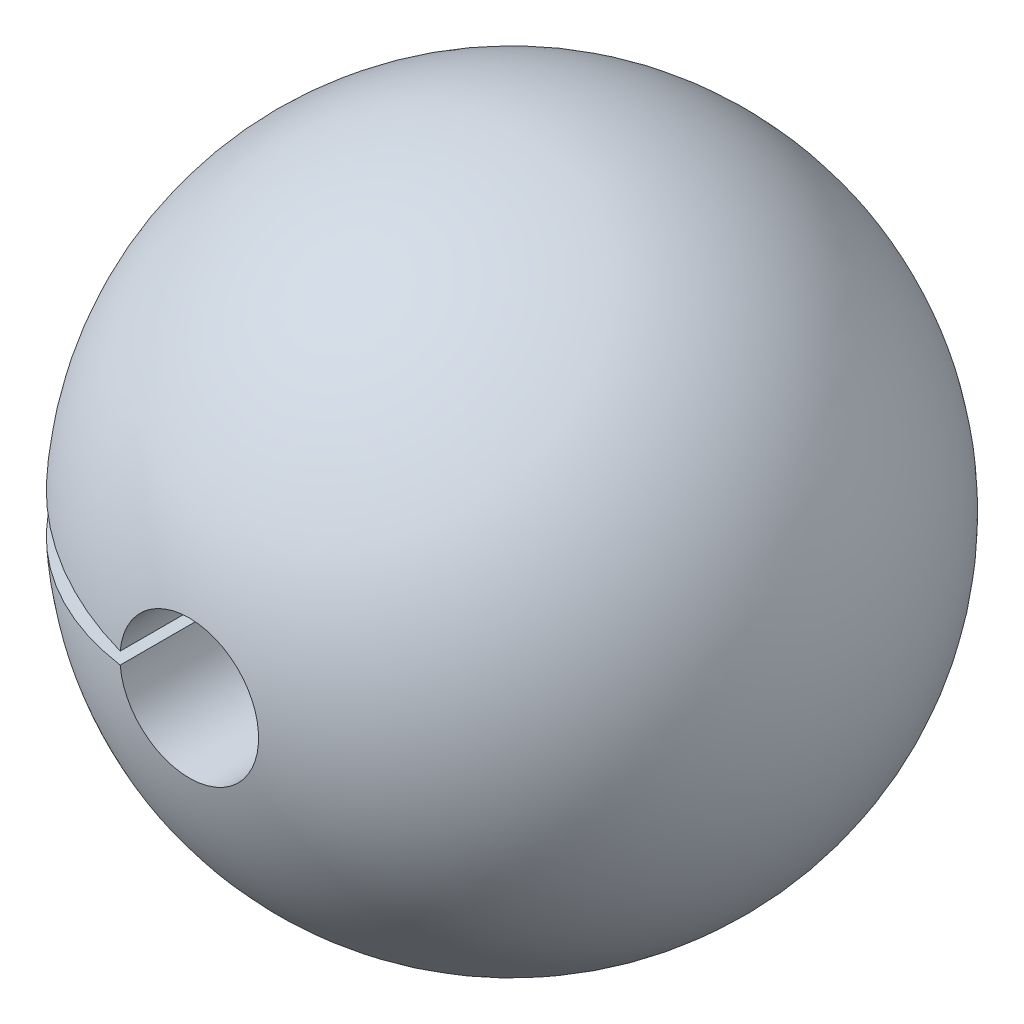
from build123d import *

# Parameters (mm, degrees)
SKETCH_2_R          = 301
CUT_EXTRUDE_1_DEPTH = 25000
CUT_EXTRUDE_2_DEPTH = 25000


with BuildPart() as part:
    # Sketch 1 → Revolve 1 (revolve)
    with BuildSketch(Plane(origin=(0, 0, 0), x_dir=(1, 0, 0), z_dir=(0, 1, 0))):
        with BuildLine():
            Line((0, 1431), (0, -1431))
            ThreePointArc((0, -1431), (1431, 0), (0, 1431))
        make_face()
    revolve(axis=Axis((0, 0, -1431), (0, 0, 1)))

    # Sketch 2 → Cut-Extrude 1 (cut, symmetric)
    with BuildSketch(Plane.XY):
        Circle(SKETCH_2_R)
    extrude(amount=CUT_EXTRUDE_1_DEPTH, both=True, mode=Mode.SUBTRACT)

    # Sketch 3 → Cut-Extrude 2 (cut, symmetric)
    with BuildSketch(Plane.XY):
        Polygon((0, 0), (-1601.196227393, -140.086517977), (-1601.196227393, 140.086517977), align=None)
    extrude(amount=CUT_EXTRUDE_2_DEPTH, both=True, mode=Mode.SUBTRACT)


solid = part.part
